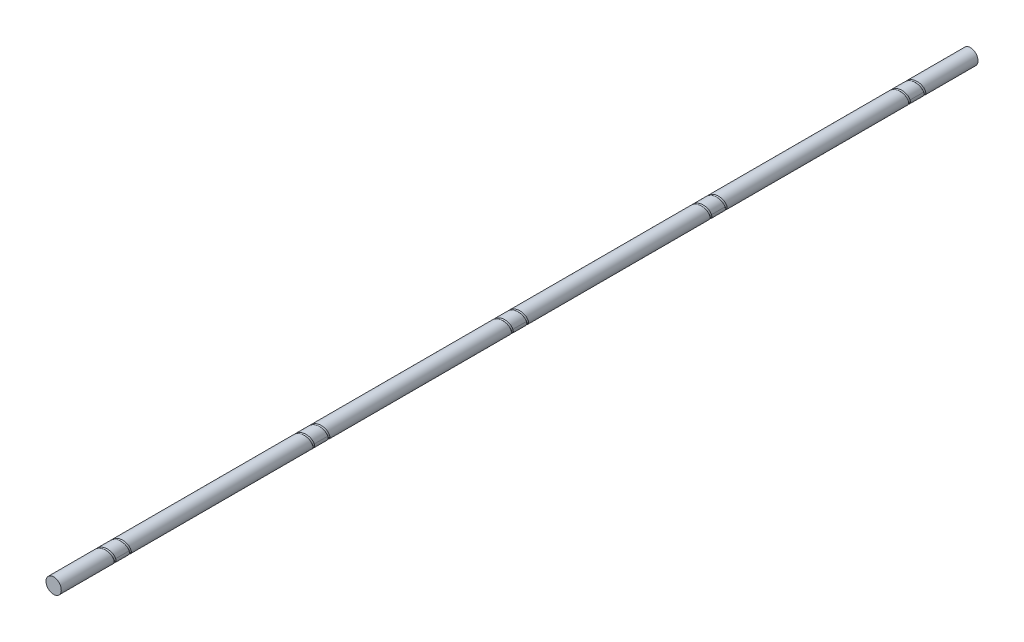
from build123d import *

# Parameters (mm, degrees)
SKETCH1_R              = 25
BOSS_EXTRUDE1_DEPTH    = 3000
CUT_SWEEP1_PITCH       = 50
CUT_SWEEP1_HEIGHT      = 100
CUT_SWEEP1_RADIUS      = 27.646
CUT_SWEEP1_START_ANGLE = -180
SKETCH3_R              = 3.969
LPATTERN1_COUNT        = 5
LPATTERN1_PITCH        = 650


with BuildPart() as part:
    # Sketch1 → Boss-Extrude1 (new body)
    with BuildSketch(Plane.XY):
        Circle(SKETCH1_R)
    extrude(amount=BOSS_EXTRUDE1_DEPTH)

    # Cut-Sweep1: sweep along a helix
    with BuildLine() as cut_sweep1_path:
        add(Helix(CUT_SWEEP1_PITCH, CUT_SWEEP1_HEIGHT, CUT_SWEEP1_RADIUS, center=(0, 0, 150), direction=(0, 0, 1), mode=Mode.PRIVATE).rotate(Axis((0, 0, 150), (0, 0, 1)), CUT_SWEEP1_START_ANGLE))
    # Sketch3 → Cut-Sweep1 (sweep, cut)
    with BuildSketch(Plane(origin=(0, 0, 0), x_dir=(1, 0, 0), z_dir=(0, 1, 0))):
        with Locations((-27.646, -150)):
            Circle(SKETCH3_R)
    cut_sweep1 = sweep(path=cut_sweep1_path.line, is_frenet=True, mode=Mode.SUBTRACT)

    # LPattern1: Cut-Sweep1 ×5
    with Locations(*[(0, 0, i * LPATTERN1_PITCH) for i in range(1, LPATTERN1_COUNT)]):
        add(cut_sweep1, mode=Mode.SUBTRACT)


solid = part.part
